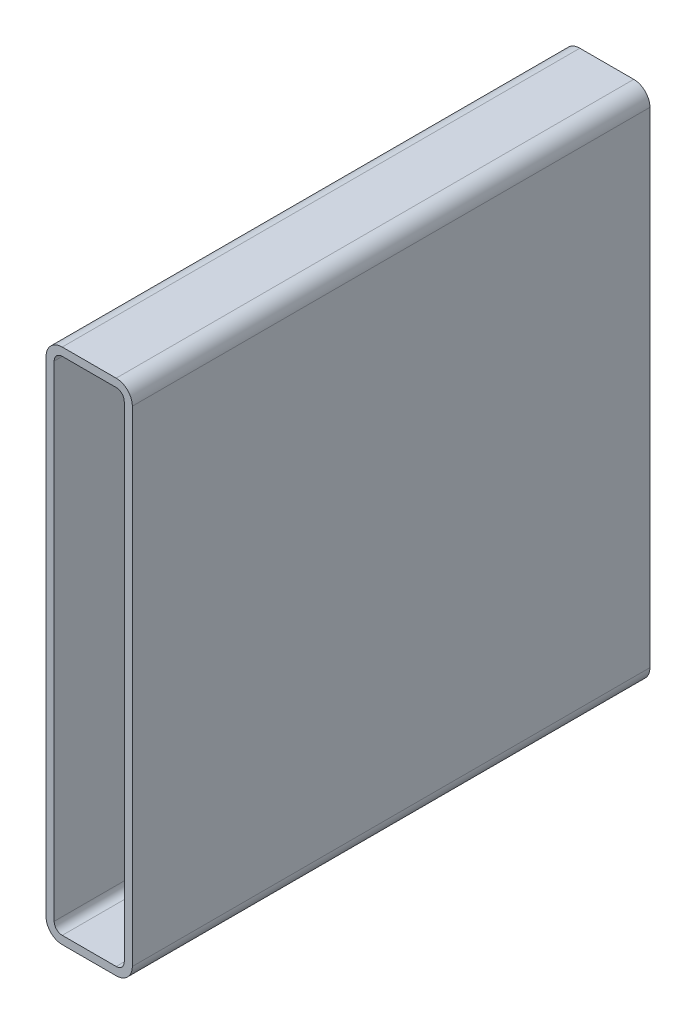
ISO-10303-21;
HEADER;
FILE_DESCRIPTION(('STEP AP214'),'2;1');
FILE_NAME('part.step','',(''),(''),'','','');
FILE_SCHEMA(('AUTOMOTIVE_DESIGN { 1 0 10303 214 1 1 1 1 }'));
ENDSEC;
DATA;
#1=APPLICATION_CONTEXT('core data for automotive mechanical design processes');
#2=APPLICATION_PROTOCOL_DEFINITION('international standard','automotive_design',2000,#1);
#3=PRODUCT_CONTEXT('',#1,'mechanical');
#4=PRODUCT('Part','Part','',(#3));
#5=PRODUCT_RELATED_PRODUCT_CATEGORY('part','',(#4));
#6=PRODUCT_DEFINITION_FORMATION('','',#4);
#7=PRODUCT_DEFINITION_CONTEXT('part definition',#1,'design');
#8=PRODUCT_DEFINITION('design','',#6,#7);
#9=PRODUCT_DEFINITION_SHAPE('','',#8);
#10=(LENGTH_UNIT() NAMED_UNIT(*) SI_UNIT(.MILLI.,.METRE.));
#11=(NAMED_UNIT(*) PLANE_ANGLE_UNIT() SI_UNIT($,.RADIAN.));
#12=(NAMED_UNIT(*) SI_UNIT($,.STERADIAN.) SOLID_ANGLE_UNIT());
#13=UNCERTAINTY_MEASURE_WITH_UNIT(LENGTH_MEASURE(1.E-05),#10,'distance_accuracy_value','');
#14=(GEOMETRIC_REPRESENTATION_CONTEXT(3) GLOBAL_UNCERTAINTY_ASSIGNED_CONTEXT((#13)) GLOBAL_UNIT_ASSIGNED_CONTEXT((#10,
#11,#12)) REPRESENTATION_CONTEXT('',''));
#15=CARTESIAN_POINT('',(0.,0.,0.));
#16=DIRECTION('',(0.,0.,1.));
#17=DIRECTION('',(1.,0.,0.));
#18=AXIS2_PLACEMENT_3D('',#15,#16,#17);
#19=CARTESIAN_POINT('',(9.52500000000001,295.275,304.8));
#20=DIRECTION('',(0.,0.,1.));
#21=DIRECTION('',(1.,0.,0.));
#22=AXIS2_PLACEMENT_3D('',#19,#20,#21);
#23=PLANE('',#22);
#24=CARTESIAN_POINT('',(9.52500000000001,295.275,304.8));
#25=DIRECTION('',(0.,0.,1.));
#26=DIRECTION('',(1.,0.,0.));
#27=AXIS2_PLACEMENT_3D('',#24,#25,#26);
#28=CIRCLE('',#27,9.52500000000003);
#29=CARTESIAN_POINT('',(9.525,304.8,304.8));
#30=VERTEX_POINT('',#29);
#31=CARTESIAN_POINT('',(0.,295.275,304.8));
#32=VERTEX_POINT('',#31);
#33=EDGE_CURVE('E211',#30,#32,#28,.T.);
#34=ORIENTED_EDGE('',*,*,#33,.T.);
#35=DIRECTION('',(0.,-1.,0.));
#36=VECTOR('',#35,1.);
#37=CARTESIAN_POINT('',(0.,9.525,304.8));
#38=LINE('',#37,#36);
#39=CARTESIAN_POINT('',(0.,9.525,304.8));
#40=VERTEX_POINT('',#39);
#41=EDGE_CURVE('E214',#32,#40,#38,.T.);
#42=ORIENTED_EDGE('',*,*,#41,.T.);
#43=CARTESIAN_POINT('',(9.525,9.525,304.8));
#44=DIRECTION('',(0.,0.,1.));
#45=DIRECTION('',(1.,0.,0.));
#46=AXIS2_PLACEMENT_3D('',#43,#44,#45);
#47=CIRCLE('',#46,9.525);
#48=CARTESIAN_POINT('',(9.525,0.,304.8));
#49=VERTEX_POINT('',#48);
#50=EDGE_CURVE('E217',#40,#49,#47,.T.);
#51=ORIENTED_EDGE('',*,*,#50,.T.);
#52=DIRECTION('',(1.,0.,0.));
#53=VECTOR('',#52,1.);
#54=CARTESIAN_POINT('',(41.275,0.,304.8));
#55=LINE('',#54,#53);
#56=CARTESIAN_POINT('',(41.275,0.,304.8));
#57=VERTEX_POINT('',#56);
#58=EDGE_CURVE('E219',#49,#57,#55,.T.);
#59=ORIENTED_EDGE('',*,*,#58,.T.);
#60=CARTESIAN_POINT('',(41.275,9.525,304.8));
#61=DIRECTION('',(0.,0.,1.));
#62=DIRECTION('',(1.,0.,0.));
#63=AXIS2_PLACEMENT_3D('',#60,#61,#62);
#64=CIRCLE('',#63,9.525);
#65=CARTESIAN_POINT('',(50.8,9.525,304.8));
#66=VERTEX_POINT('',#65);
#67=EDGE_CURVE('E221',#57,#66,#64,.T.);
#68=ORIENTED_EDGE('',*,*,#67,.T.);
#69=DIRECTION('',(0.,1.,0.));
#70=VECTOR('',#69,1.);
#71=CARTESIAN_POINT('',(50.8,295.275,304.8));
#72=LINE('',#71,#70);
#73=CARTESIAN_POINT('',(50.8,295.275,304.8));
#74=VERTEX_POINT('',#73);
#75=EDGE_CURVE('E223',#66,#74,#72,.T.);
#76=ORIENTED_EDGE('',*,*,#75,.T.);
#77=CARTESIAN_POINT('',(41.275,295.275,304.8));
#78=DIRECTION('',(0.,0.,1.));
#79=DIRECTION('',(1.,0.,0.));
#80=AXIS2_PLACEMENT_3D('',#77,#78,#79);
#81=CIRCLE('',#80,9.52500000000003);
#82=CARTESIAN_POINT('',(41.275,304.8,304.8));
#83=VERTEX_POINT('',#82);
#84=EDGE_CURVE('E225',#74,#83,#81,.T.);
#85=ORIENTED_EDGE('',*,*,#84,.T.);
#86=DIRECTION('',(-1.,0.,0.));
#87=VECTOR('',#86,1.);
#88=CARTESIAN_POINT('',(9.525,304.8,304.8));
#89=LINE('',#88,#87);
#90=EDGE_CURVE('E227',#83,#30,#89,.T.);
#91=ORIENTED_EDGE('',*,*,#90,.T.);
#92=EDGE_LOOP('',(#34,#42,#51,#59,#68,#76,#85,#91));
#93=FACE_BOUND('',#92,.T.);
#94=DIRECTION('',(0.,-1.,0.));
#95=VECTOR('',#94,1.);
#96=CARTESIAN_POINT('',(4.7625,9.525,304.8));
#97=LINE('',#96,#95);
#98=CARTESIAN_POINT('',(4.7625,295.275,304.8));
#99=VERTEX_POINT('',#98);
#100=CARTESIAN_POINT('',(4.7625,9.525,304.8));
#101=VERTEX_POINT('',#100);
#102=EDGE_CURVE('E154',#99,#101,#97,.T.);
#103=ORIENTED_EDGE('',*,*,#102,.F.);
#104=CARTESIAN_POINT('',(9.52500000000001,295.275,304.8));
#105=DIRECTION('',(0.,0.,1.));
#106=DIRECTION('',(1.,0.,0.));
#107=AXIS2_PLACEMENT_3D('',#104,#105,#106);
#108=CIRCLE('',#107,4.76250000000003);
#109=CARTESIAN_POINT('',(9.525,300.0375,304.8));
#110=VERTEX_POINT('',#109);
#111=EDGE_CURVE('E146',#110,#99,#108,.T.);
#112=ORIENTED_EDGE('',*,*,#111,.F.);
#113=DIRECTION('',(-1.,0.,0.));
#114=VECTOR('',#113,1.);
#115=CARTESIAN_POINT('',(9.525,300.0375,304.8));
#116=LINE('',#115,#114);
#117=CARTESIAN_POINT('',(41.275,300.0375,304.8));
#118=VERTEX_POINT('',#117);
#119=EDGE_CURVE('E179',#118,#110,#116,.T.);
#120=ORIENTED_EDGE('',*,*,#119,.F.);
#121=CARTESIAN_POINT('',(41.275,295.275,304.8));
#122=DIRECTION('',(0.,0.,1.));
#123=DIRECTION('',(1.,0.,0.));
#124=AXIS2_PLACEMENT_3D('',#121,#122,#123);
#125=CIRCLE('',#124,4.76250000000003);
#126=CARTESIAN_POINT('',(46.0375,295.275,304.8));
#127=VERTEX_POINT('',#126);
#128=EDGE_CURVE('E177',#127,#118,#125,.T.);
#129=ORIENTED_EDGE('',*,*,#128,.F.);
#130=DIRECTION('',(0.,1.,0.));
#131=VECTOR('',#130,1.);
#132=CARTESIAN_POINT('',(46.0375,295.275,304.8));
#133=LINE('',#132,#131);
#134=CARTESIAN_POINT('',(46.0375,9.525,304.8));
#135=VERTEX_POINT('',#134);
#136=EDGE_CURVE('E175',#135,#127,#133,.T.);
#137=ORIENTED_EDGE('',*,*,#136,.F.);
#138=CARTESIAN_POINT('',(41.275,9.525,304.8));
#139=DIRECTION('',(0.,0.,1.));
#140=DIRECTION('',(1.,0.,0.));
#141=AXIS2_PLACEMENT_3D('',#138,#139,#140);
#142=CIRCLE('',#141,4.7625);
#143=CARTESIAN_POINT('',(41.275,4.7625,304.8));
#144=VERTEX_POINT('',#143);
#145=EDGE_CURVE('E173',#144,#135,#142,.T.);
#146=ORIENTED_EDGE('',*,*,#145,.F.);
#147=DIRECTION('',(1.,0.,0.));
#148=VECTOR('',#147,1.);
#149=CARTESIAN_POINT('',(41.275,4.7625,304.8));
#150=LINE('',#149,#148);
#151=CARTESIAN_POINT('',(9.525,4.7625,304.8));
#152=VERTEX_POINT('',#151);
#153=EDGE_CURVE('E169',#152,#144,#150,.T.);
#154=ORIENTED_EDGE('',*,*,#153,.F.);
#155=CARTESIAN_POINT('',(9.525,9.525,304.8));
#156=DIRECTION('',(0.,0.,1.));
#157=DIRECTION('',(1.,0.,0.));
#158=AXIS2_PLACEMENT_3D('',#155,#156,#157);
#159=CIRCLE('',#158,4.7625);
#160=EDGE_CURVE('E167',#101,#152,#159,.T.);
#161=ORIENTED_EDGE('',*,*,#160,.F.);
#162=EDGE_LOOP('',(#103,#112,#120,#129,#137,#146,#154,#161));
#163=FACE_BOUND('',#162,.T.);
#164=ADVANCED_FACE('F33',(#93,#163),#23,.T.);
#165=CARTESIAN_POINT('',(9.52500000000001,295.275,0.));
#166=DIRECTION('',(0.,0.,1.));
#167=DIRECTION('',(1.,0.,0.));
#168=AXIS2_PLACEMENT_3D('',#165,#166,#167);
#169=PLANE('',#168);
#170=CARTESIAN_POINT('',(9.52500000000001,295.275,0.));
#171=DIRECTION('',(0.,0.,1.));
#172=DIRECTION('',(1.,0.,0.));
#173=AXIS2_PLACEMENT_3D('',#170,#171,#172);
#174=CIRCLE('',#173,9.52500000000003);
#175=CARTESIAN_POINT('',(9.525,304.8,0.));
#176=VERTEX_POINT('',#175);
#177=CARTESIAN_POINT('',(0.,295.275,0.));
#178=VERTEX_POINT('',#177);
#179=EDGE_CURVE('E162',#176,#178,#174,.T.);
#180=ORIENTED_EDGE('',*,*,#179,.F.);
#181=DIRECTION('',(-1.,0.,0.));
#182=VECTOR('',#181,1.);
#183=CARTESIAN_POINT('',(9.525,304.8,0.));
#184=LINE('',#183,#182);
#185=CARTESIAN_POINT('',(41.275,304.8,0.));
#186=VERTEX_POINT('',#185);
#187=EDGE_CURVE('E215',#186,#176,#184,.T.);
#188=ORIENTED_EDGE('',*,*,#187,.F.);
#189=CARTESIAN_POINT('',(41.275,295.275,0.));
#190=DIRECTION('',(0.,0.,1.));
#191=DIRECTION('',(1.,0.,0.));
#192=AXIS2_PLACEMENT_3D('',#189,#190,#191);
#193=CIRCLE('',#192,9.52500000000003);
#194=CARTESIAN_POINT('',(50.8,295.275,0.));
#195=VERTEX_POINT('',#194);
#196=EDGE_CURVE('E242',#195,#186,#193,.T.);
#197=ORIENTED_EDGE('',*,*,#196,.F.);
#198=DIRECTION('',(0.,1.,0.));
#199=VECTOR('',#198,1.);
#200=CARTESIAN_POINT('',(50.8,295.275,0.));
#201=LINE('',#200,#199);
#202=CARTESIAN_POINT('',(50.8,9.525,0.));
#203=VERTEX_POINT('',#202);
#204=EDGE_CURVE('E240',#203,#195,#201,.T.);
#205=ORIENTED_EDGE('',*,*,#204,.F.);
#206=CARTESIAN_POINT('',(41.275,9.525,0.));
#207=DIRECTION('',(0.,0.,1.));
#208=DIRECTION('',(1.,0.,0.));
#209=AXIS2_PLACEMENT_3D('',#206,#207,#208);
#210=CIRCLE('',#209,9.525);
#211=CARTESIAN_POINT('',(41.275,0.,0.));
#212=VERTEX_POINT('',#211);
#213=EDGE_CURVE('E238',#212,#203,#210,.T.);
#214=ORIENTED_EDGE('',*,*,#213,.F.);
#215=DIRECTION('',(1.,0.,0.));
#216=VECTOR('',#215,1.);
#217=CARTESIAN_POINT('',(41.275,0.,0.));
#218=LINE('',#217,#216);
#219=CARTESIAN_POINT('',(9.525,0.,0.));
#220=VERTEX_POINT('',#219);
#221=EDGE_CURVE('E236',#220,#212,#218,.T.);
#222=ORIENTED_EDGE('',*,*,#221,.F.);
#223=CARTESIAN_POINT('',(9.525,9.525,0.));
#224=DIRECTION('',(0.,0.,1.));
#225=DIRECTION('',(1.,0.,0.));
#226=AXIS2_PLACEMENT_3D('',#223,#224,#225);
#227=CIRCLE('',#226,9.525);
#228=CARTESIAN_POINT('',(0.,9.525,0.));
#229=VERTEX_POINT('',#228);
#230=EDGE_CURVE('E234',#229,#220,#227,.T.);
#231=ORIENTED_EDGE('',*,*,#230,.F.);
#232=DIRECTION('',(0.,-1.,0.));
#233=VECTOR('',#232,1.);
#234=CARTESIAN_POINT('',(0.,9.525,0.));
#235=LINE('',#234,#233);
#236=EDGE_CURVE('E232',#178,#229,#235,.T.);
#237=ORIENTED_EDGE('',*,*,#236,.F.);
#238=EDGE_LOOP('',(#180,#188,#197,#205,#214,#222,#231,#237));
#239=FACE_BOUND('',#238,.T.);
#240=CARTESIAN_POINT('',(9.52500000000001,295.275,0.));
#241=DIRECTION('',(0.,0.,1.));
#242=DIRECTION('',(1.,0.,0.));
#243=AXIS2_PLACEMENT_3D('',#240,#241,#242);
#244=CIRCLE('',#243,4.76250000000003);
#245=CARTESIAN_POINT('',(9.525,300.0375,0.));
#246=VERTEX_POINT('',#245);
#247=CARTESIAN_POINT('',(4.7625,295.275,0.));
#248=VERTEX_POINT('',#247);
#249=EDGE_CURVE('E56',#246,#248,#244,.T.);
#250=ORIENTED_EDGE('',*,*,#249,.T.);
#251=DIRECTION('',(0.,-1.,0.));
#252=VECTOR('',#251,1.);
#253=CARTESIAN_POINT('',(4.7625,9.525,0.));
#254=LINE('',#253,#252);
#255=CARTESIAN_POINT('',(4.7625,9.525,0.));
#256=VERTEX_POINT('',#255);
#257=EDGE_CURVE('E161',#248,#256,#254,.T.);
#258=ORIENTED_EDGE('',*,*,#257,.T.);
#259=CARTESIAN_POINT('',(9.525,9.525,0.));
#260=DIRECTION('',(0.,0.,1.));
#261=DIRECTION('',(1.,0.,0.));
#262=AXIS2_PLACEMENT_3D('',#259,#260,#261);
#263=CIRCLE('',#262,4.7625);
#264=CARTESIAN_POINT('',(9.525,4.7625,0.));
#265=VERTEX_POINT('',#264);
#266=EDGE_CURVE('E183',#256,#265,#263,.T.);
#267=ORIENTED_EDGE('',*,*,#266,.T.);
#268=DIRECTION('',(1.,0.,0.));
#269=VECTOR('',#268,1.);
#270=CARTESIAN_POINT('',(41.275,4.7625,0.));
#271=LINE('',#270,#269);
#272=CARTESIAN_POINT('',(41.275,4.7625,0.));
#273=VERTEX_POINT('',#272);
#274=EDGE_CURVE('E186',#265,#273,#271,.T.);
#275=ORIENTED_EDGE('',*,*,#274,.T.);
#276=CARTESIAN_POINT('',(41.275,9.525,0.));
#277=DIRECTION('',(0.,0.,1.));
#278=DIRECTION('',(1.,0.,0.));
#279=AXIS2_PLACEMENT_3D('',#276,#277,#278);
#280=CIRCLE('',#279,4.7625);
#281=CARTESIAN_POINT('',(46.0375,9.525,0.));
#282=VERTEX_POINT('',#281);
#283=EDGE_CURVE('E189',#273,#282,#280,.T.);
#284=ORIENTED_EDGE('',*,*,#283,.T.);
#285=DIRECTION('',(0.,1.,0.));
#286=VECTOR('',#285,1.);
#287=CARTESIAN_POINT('',(46.0375,295.275,0.));
#288=LINE('',#287,#286);
#289=CARTESIAN_POINT('',(46.0375,295.275,0.));
#290=VERTEX_POINT('',#289);
#291=EDGE_CURVE('E192',#282,#290,#288,.T.);
#292=ORIENTED_EDGE('',*,*,#291,.T.);
#293=CARTESIAN_POINT('',(41.275,295.275,0.));
#294=DIRECTION('',(0.,0.,1.));
#295=DIRECTION('',(1.,0.,0.));
#296=AXIS2_PLACEMENT_3D('',#293,#294,#295);
#297=CIRCLE('',#296,4.76250000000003);
#298=CARTESIAN_POINT('',(41.275,300.0375,0.));
#299=VERTEX_POINT('',#298);
#300=EDGE_CURVE('E195',#290,#299,#297,.T.);
#301=ORIENTED_EDGE('',*,*,#300,.T.);
#302=DIRECTION('',(-1.,0.,0.));
#303=VECTOR('',#302,1.);
#304=CARTESIAN_POINT('',(9.525,300.0375,0.));
#305=LINE('',#304,#303);
#306=EDGE_CURVE('E155',#299,#246,#305,.T.);
#307=ORIENTED_EDGE('',*,*,#306,.T.);
#308=EDGE_LOOP('',(#250,#258,#267,#275,#284,#292,#301,#307));
#309=FACE_BOUND('',#308,.T.);
#310=ADVANCED_FACE('F272',(#239,#309),#169,.F.);
#311=CARTESIAN_POINT('',(9.52500000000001,295.275,304.8));
#312=DIRECTION('',(0.,0.,-1.));
#313=DIRECTION('',(-1.,0.,0.));
#314=AXIS2_PLACEMENT_3D('',#311,#312,#313);
#315=CYLINDRICAL_SURFACE('',#314,9.52500000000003);
#316=ORIENTED_EDGE('',*,*,#179,.T.);
#317=DIRECTION('',(0.,0.,-1.));
#318=VECTOR('',#317,1.);
#319=CARTESIAN_POINT('',(0.,295.275,304.8));
#320=LINE('',#319,#318);
#321=EDGE_CURVE('E11',#32,#178,#320,.T.);
#322=ORIENTED_EDGE('',*,*,#321,.F.);
#323=ORIENTED_EDGE('',*,*,#33,.F.);
#324=DIRECTION('',(0.,0.,-1.));
#325=VECTOR('',#324,1.);
#326=CARTESIAN_POINT('',(9.525,304.8,304.8));
#327=LINE('',#326,#325);
#328=EDGE_CURVE('E229',#30,#176,#327,.T.);
#329=ORIENTED_EDGE('',*,*,#328,.T.);
#330=EDGE_LOOP('',(#316,#322,#323,#329));
#331=FACE_BOUND('',#330,.T.);
#332=ADVANCED_FACE('F35',(#331),#315,.T.);
#333=CARTESIAN_POINT('',(0.,9.525,304.8));
#334=DIRECTION('',(1.,0.,0.));
#335=DIRECTION('',(0.,0.,-1.));
#336=AXIS2_PLACEMENT_3D('',#333,#334,#335);
#337=PLANE('',#336);
#338=ORIENTED_EDGE('',*,*,#236,.T.);
#339=DIRECTION('',(0.,0.,-1.));
#340=VECTOR('',#339,1.);
#341=CARTESIAN_POINT('',(0.,9.525,304.8));
#342=LINE('',#341,#340);
#343=EDGE_CURVE('E41',#40,#229,#342,.T.);
#344=ORIENTED_EDGE('',*,*,#343,.F.);
#345=ORIENTED_EDGE('',*,*,#41,.F.);
#346=ORIENTED_EDGE('',*,*,#321,.T.);
#347=EDGE_LOOP('',(#338,#344,#345,#346));
#348=FACE_BOUND('',#347,.T.);
#349=ADVANCED_FACE('F289',(#348),#337,.F.);
#350=CARTESIAN_POINT('',(9.525,9.525,304.8));
#351=DIRECTION('',(0.,0.,-1.));
#352=DIRECTION('',(-1.,0.,0.));
#353=AXIS2_PLACEMENT_3D('',#350,#351,#352);
#354=CYLINDRICAL_SURFACE('',#353,9.525);
#355=ORIENTED_EDGE('',*,*,#230,.T.);
#356=DIRECTION('',(0.,0.,-1.));
#357=VECTOR('',#356,1.);
#358=CARTESIAN_POINT('',(9.525,0.,304.8));
#359=LINE('',#358,#357);
#360=EDGE_CURVE('E259',#49,#220,#359,.T.);
#361=ORIENTED_EDGE('',*,*,#360,.F.);
#362=ORIENTED_EDGE('',*,*,#50,.F.);
#363=ORIENTED_EDGE('',*,*,#343,.T.);
#364=EDGE_LOOP('',(#355,#361,#362,#363));
#365=FACE_BOUND('',#364,.T.);
#366=ADVANCED_FACE('F266',(#365),#354,.T.);
#367=CARTESIAN_POINT('',(41.275,0.,304.8));
#368=DIRECTION('',(0.,1.,0.));
#369=DIRECTION('',(0.,0.,1.));
#370=AXIS2_PLACEMENT_3D('',#367,#368,#369);
#371=PLANE('',#370);
#372=ORIENTED_EDGE('',*,*,#221,.T.);
#373=DIRECTION('',(0.,0.,-1.));
#374=VECTOR('',#373,1.);
#375=CARTESIAN_POINT('',(41.275,0.,304.8));
#376=LINE('',#375,#374);
#377=EDGE_CURVE('E256',#57,#212,#376,.T.);
#378=ORIENTED_EDGE('',*,*,#377,.F.);
#379=ORIENTED_EDGE('',*,*,#58,.F.);
#380=ORIENTED_EDGE('',*,*,#360,.T.);
#381=EDGE_LOOP('',(#372,#378,#379,#380));
#382=FACE_BOUND('',#381,.T.);
#383=ADVANCED_FACE('F278',(#382),#371,.F.);
#384=CARTESIAN_POINT('',(41.275,9.525,304.8));
#385=DIRECTION('',(0.,0.,-1.));
#386=DIRECTION('',(-1.,0.,0.));
#387=AXIS2_PLACEMENT_3D('',#384,#385,#386);
#388=CYLINDRICAL_SURFACE('',#387,9.525);
#389=ORIENTED_EDGE('',*,*,#213,.T.);
#390=DIRECTION('',(0.,0.,-1.));
#391=VECTOR('',#390,1.);
#392=CARTESIAN_POINT('',(50.8,9.525,304.8));
#393=LINE('',#392,#391);
#394=EDGE_CURVE('E253',#66,#203,#393,.T.);
#395=ORIENTED_EDGE('',*,*,#394,.F.);
#396=ORIENTED_EDGE('',*,*,#67,.F.);
#397=ORIENTED_EDGE('',*,*,#377,.T.);
#398=EDGE_LOOP('',(#389,#395,#396,#397));
#399=FACE_BOUND('',#398,.T.);
#400=ADVANCED_FACE('F282',(#399),#388,.T.);
#401=CARTESIAN_POINT('',(50.8,295.275,304.8));
#402=DIRECTION('',(-1.,0.,0.));
#403=DIRECTION('',(0.,0.,1.));
#404=AXIS2_PLACEMENT_3D('',#401,#402,#403);
#405=PLANE('',#404);
#406=ORIENTED_EDGE('',*,*,#204,.T.);
#407=DIRECTION('',(0.,0.,-1.));
#408=VECTOR('',#407,1.);
#409=CARTESIAN_POINT('',(50.8,295.275,304.8));
#410=LINE('',#409,#408);
#411=EDGE_CURVE('E250',#74,#195,#410,.T.);
#412=ORIENTED_EDGE('',*,*,#411,.F.);
#413=ORIENTED_EDGE('',*,*,#75,.F.);
#414=ORIENTED_EDGE('',*,*,#394,.T.);
#415=EDGE_LOOP('',(#406,#412,#413,#414));
#416=FACE_BOUND('',#415,.T.);
#417=ADVANCED_FACE('F302',(#416),#405,.F.);
#418=CARTESIAN_POINT('',(41.275,295.275,304.8));
#419=DIRECTION('',(0.,0.,-1.));
#420=DIRECTION('',(-1.,0.,0.));
#421=AXIS2_PLACEMENT_3D('',#418,#419,#420);
#422=CYLINDRICAL_SURFACE('',#421,9.52500000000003);
#423=ORIENTED_EDGE('',*,*,#196,.T.);
#424=DIRECTION('',(0.,0.,-1.));
#425=VECTOR('',#424,1.);
#426=CARTESIAN_POINT('',(41.275,304.8,304.8));
#427=LINE('',#426,#425);
#428=EDGE_CURVE('E247',#83,#186,#427,.T.);
#429=ORIENTED_EDGE('',*,*,#428,.F.);
#430=ORIENTED_EDGE('',*,*,#84,.F.);
#431=ORIENTED_EDGE('',*,*,#411,.T.);
#432=EDGE_LOOP('',(#423,#429,#430,#431));
#433=FACE_BOUND('',#432,.T.);
#434=ADVANCED_FACE('F300',(#433),#422,.T.);
#435=CARTESIAN_POINT('',(9.525,304.8,304.8));
#436=DIRECTION('',(0.,-1.,0.));
#437=DIRECTION('',(0.,0.,-1.));
#438=AXIS2_PLACEMENT_3D('',#435,#436,#437);
#439=PLANE('',#438);
#440=ORIENTED_EDGE('',*,*,#187,.T.);
#441=ORIENTED_EDGE('',*,*,#328,.F.);
#442=ORIENTED_EDGE('',*,*,#90,.F.);
#443=ORIENTED_EDGE('',*,*,#428,.T.);
#444=EDGE_LOOP('',(#440,#441,#442,#443));
#445=FACE_BOUND('',#444,.T.);
#446=ADVANCED_FACE('F295',(#445),#439,.F.);
#447=CARTESIAN_POINT('',(9.52500000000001,295.275,304.8));
#448=DIRECTION('',(0.,0.,-1.));
#449=DIRECTION('',(-1.,0.,0.));
#450=AXIS2_PLACEMENT_3D('',#447,#448,#449);
#451=CYLINDRICAL_SURFACE('',#450,4.76250000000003);
#452=ORIENTED_EDGE('',*,*,#249,.F.);
#453=DIRECTION('',(0.,0.,-1.));
#454=VECTOR('',#453,1.);
#455=CARTESIAN_POINT('',(9.525,300.0375,304.8));
#456=LINE('',#455,#454);
#457=EDGE_CURVE('E150',#110,#246,#456,.T.);
#458=ORIENTED_EDGE('',*,*,#457,.F.);
#459=ORIENTED_EDGE('',*,*,#111,.T.);
#460=DIRECTION('',(0.,0.,-1.));
#461=VECTOR('',#460,1.);
#462=CARTESIAN_POINT('',(4.7625,295.275,304.8));
#463=LINE('',#462,#461);
#464=EDGE_CURVE('E149',#99,#248,#463,.T.);
#465=ORIENTED_EDGE('',*,*,#464,.T.);
#466=EDGE_LOOP('',(#452,#458,#459,#465));
#467=FACE_BOUND('',#466,.T.);
#468=ADVANCED_FACE('F148',(#467),#451,.F.);
#469=CARTESIAN_POINT('',(4.7625,9.525,304.8));
#470=DIRECTION('',(1.,0.,0.));
#471=DIRECTION('',(0.,0.,-1.));
#472=AXIS2_PLACEMENT_3D('',#469,#470,#471);
#473=PLANE('',#472);
#474=ORIENTED_EDGE('',*,*,#257,.F.);
#475=ORIENTED_EDGE('',*,*,#464,.F.);
#476=ORIENTED_EDGE('',*,*,#102,.T.);
#477=DIRECTION('',(0.,0.,-1.));
#478=VECTOR('',#477,1.);
#479=CARTESIAN_POINT('',(4.7625,9.525,304.8));
#480=LINE('',#479,#478);
#481=EDGE_CURVE('E163',#101,#256,#480,.T.);
#482=ORIENTED_EDGE('',*,*,#481,.T.);
#483=EDGE_LOOP('',(#474,#475,#476,#482));
#484=FACE_BOUND('',#483,.T.);
#485=ADVANCED_FACE('F158',(#484),#473,.T.);
#486=CARTESIAN_POINT('',(9.525,9.525,304.8));
#487=DIRECTION('',(0.,0.,-1.));
#488=DIRECTION('',(-1.,0.,0.));
#489=AXIS2_PLACEMENT_3D('',#486,#487,#488);
#490=CYLINDRICAL_SURFACE('',#489,4.7625);
#491=ORIENTED_EDGE('',*,*,#266,.F.);
#492=ORIENTED_EDGE('',*,*,#481,.F.);
#493=ORIENTED_EDGE('',*,*,#160,.T.);
#494=DIRECTION('',(0.,0.,-1.));
#495=VECTOR('',#494,1.);
#496=CARTESIAN_POINT('',(9.525,4.7625,304.8));
#497=LINE('',#496,#495);
#498=EDGE_CURVE('E208',#152,#265,#497,.T.);
#499=ORIENTED_EDGE('',*,*,#498,.T.);
#500=EDGE_LOOP('',(#491,#492,#493,#499));
#501=FACE_BOUND('',#500,.T.);
#502=ADVANCED_FACE('F327',(#501),#490,.F.);
#503=CARTESIAN_POINT('',(41.275,4.7625,304.8));
#504=DIRECTION('',(0.,1.,0.));
#505=DIRECTION('',(0.,0.,1.));
#506=AXIS2_PLACEMENT_3D('',#503,#504,#505);
#507=PLANE('',#506);
#508=ORIENTED_EDGE('',*,*,#274,.F.);
#509=ORIENTED_EDGE('',*,*,#498,.F.);
#510=ORIENTED_EDGE('',*,*,#153,.T.);
#511=DIRECTION('',(0.,0.,-1.));
#512=VECTOR('',#511,1.);
#513=CARTESIAN_POINT('',(41.275,4.7625,304.8));
#514=LINE('',#513,#512);
#515=EDGE_CURVE('E206',#144,#273,#514,.T.);
#516=ORIENTED_EDGE('',*,*,#515,.T.);
#517=EDGE_LOOP('',(#508,#509,#510,#516));
#518=FACE_BOUND('',#517,.T.);
#519=ADVANCED_FACE('F331',(#518),#507,.T.);
#520=CARTESIAN_POINT('',(41.275,9.525,304.8));
#521=DIRECTION('',(0.,0.,-1.));
#522=DIRECTION('',(-1.,0.,0.));
#523=AXIS2_PLACEMENT_3D('',#520,#521,#522);
#524=CYLINDRICAL_SURFACE('',#523,4.7625);
#525=ORIENTED_EDGE('',*,*,#283,.F.);
#526=ORIENTED_EDGE('',*,*,#515,.F.);
#527=ORIENTED_EDGE('',*,*,#145,.T.);
#528=DIRECTION('',(0.,0.,-1.));
#529=VECTOR('',#528,1.);
#530=CARTESIAN_POINT('',(46.0375,9.525,304.8));
#531=LINE('',#530,#529);
#532=EDGE_CURVE('E204',#135,#282,#531,.T.);
#533=ORIENTED_EDGE('',*,*,#532,.T.);
#534=EDGE_LOOP('',(#525,#526,#527,#533));
#535=FACE_BOUND('',#534,.T.);
#536=ADVANCED_FACE('F337',(#535),#524,.F.);
#537=CARTESIAN_POINT('',(46.0375,295.275,304.8));
#538=DIRECTION('',(-1.,0.,0.));
#539=DIRECTION('',(0.,0.,1.));
#540=AXIS2_PLACEMENT_3D('',#537,#538,#539);
#541=PLANE('',#540);
#542=ORIENTED_EDGE('',*,*,#291,.F.);
#543=ORIENTED_EDGE('',*,*,#532,.F.);
#544=ORIENTED_EDGE('',*,*,#136,.T.);
#545=DIRECTION('',(0.,0.,-1.));
#546=VECTOR('',#545,1.);
#547=CARTESIAN_POINT('',(46.0375,295.275,304.8));
#548=LINE('',#547,#546);
#549=EDGE_CURVE('E202',#127,#290,#548,.T.);
#550=ORIENTED_EDGE('',*,*,#549,.T.);
#551=EDGE_LOOP('',(#542,#543,#544,#550));
#552=FACE_BOUND('',#551,.T.);
#553=ADVANCED_FACE('F341',(#552),#541,.T.);
#554=CARTESIAN_POINT('',(41.275,295.275,304.8));
#555=DIRECTION('',(0.,0.,-1.));
#556=DIRECTION('',(-1.,0.,0.));
#557=AXIS2_PLACEMENT_3D('',#554,#555,#556);
#558=CYLINDRICAL_SURFACE('',#557,4.76250000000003);
#559=ORIENTED_EDGE('',*,*,#300,.F.);
#560=ORIENTED_EDGE('',*,*,#549,.F.);
#561=ORIENTED_EDGE('',*,*,#128,.T.);
#562=DIRECTION('',(0.,0.,-1.));
#563=VECTOR('',#562,1.);
#564=CARTESIAN_POINT('',(41.275,300.0375,304.8));
#565=LINE('',#564,#563);
#566=EDGE_CURVE('E48',#118,#299,#565,.T.);
#567=ORIENTED_EDGE('',*,*,#566,.T.);
#568=EDGE_LOOP('',(#559,#560,#561,#567));
#569=FACE_BOUND('',#568,.T.);
#570=ADVANCED_FACE('F345',(#569),#558,.F.);
#571=CARTESIAN_POINT('',(9.525,300.0375,304.8));
#572=DIRECTION('',(0.,-1.,0.));
#573=DIRECTION('',(0.,0.,-1.));
#574=AXIS2_PLACEMENT_3D('',#571,#572,#573);
#575=PLANE('',#574);
#576=ORIENTED_EDGE('',*,*,#306,.F.);
#577=ORIENTED_EDGE('',*,*,#566,.F.);
#578=ORIENTED_EDGE('',*,*,#119,.T.);
#579=ORIENTED_EDGE('',*,*,#457,.T.);
#580=EDGE_LOOP('',(#576,#577,#578,#579));
#581=FACE_BOUND('',#580,.T.);
#582=ADVANCED_FACE('F349',(#581),#575,.T.);
#583=CLOSED_SHELL('',(#164,#310,#332,#349,#366,#383,#400,#417,#434,#446,#468,#485,#502,#519,
#536,#553,#570,#582));
#584=MANIFOLD_SOLID_BREP('B2',#583);
#585=ADVANCED_BREP_SHAPE_REPRESENTATION('',(#18,#584),#14);
#586=SHAPE_DEFINITION_REPRESENTATION(#9,#585);
ENDSEC;
END-ISO-10303-21;
